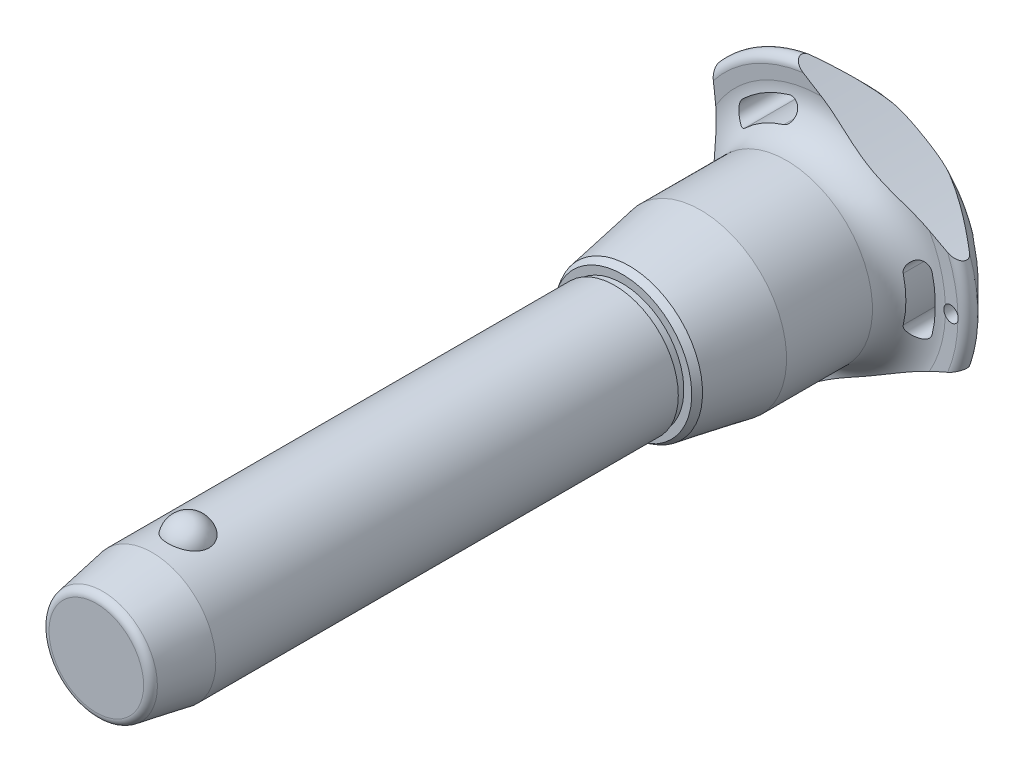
from build123d import *

# Parameters (mm, degrees)
SKETCH1_R           = 12.5
BOSS_EXTRUDE1_DEPTH = 80
SKETCH2_R           = 10
BOSS_EXTRUDE2_DEPTH = 50.7
BOSS_EXTRUDE3_START = 22
SKETCH1_2_R         = 12.5
BOSS_EXTRUDE3_DEPTH = 22
CHAMFER1_SIZE       = 11
CHAMFER1_SIZE2      = 1.939596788
FILLET1_R           = 1.5
SKETCH6_R           = 176.92625
CUT_EXTRUDE1_DEPTH  = 137.79481676
CIRPATTERN1_COUNT   = 3
SKETCH7_R           = 1.5
CUT_EXTRUDE2_DEPTH  = 137.683489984


with BuildPart() as part:
    # Sketch1 → Boss-Extrude1 (new body)
    with BuildSketch(Plane.XY):
        Circle(SKETCH1_R)
    extrude(amount=-BOSS_EXTRUDE1_DEPTH)

    # Sketch2 → Boss-Extrude2 (add)
    with BuildSketch(Plane(origin=(0, 0, -80), x_dir=(-1, 0, 0), z_dir=(0, 0, -1))):
        with Locations(Location((0, 0, 0), (0, 0, 180))):
            Circle(SKETCH2_R)
    extrude(amount=BOSS_EXTRUDE2_DEPTH)

    # Sketch3 → Revolve1 (revolve)
    with BuildSketch(Plane(origin=(0, 0, 0), x_dir=(0, 0, -1), z_dir=(1, 0, 0))):
        with BuildLine():
            Line((-3.957271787, 15.4), (-3.957271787, 7.1))
            ThreePointArc((-3.957271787, 7.1), (0.192728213, 11.25), (-3.957271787, 15.4))
        make_face()
        with BuildLine():
            Line((-3.957271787, -7.1), (-3.957271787, -15.4))
            ThreePointArc((-3.957271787, -15.4), (0.192728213, -11.25), (-3.957271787, -7.1))
        make_face()
    revolve(axis=Axis((0, -7.1, 3.957271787), (0, 1, 0)))

    # Sketch1_2 → Boss-Extrude3 (add)
    with BuildSketch(Plane.XY.offset(BOSS_EXTRUDE3_START)):
        Circle(SKETCH1_2_R)
    extrude(amount=-BOSS_EXTRUDE3_DEPTH)

    # Chamfer1
    chamfer1_edges = [part.edges().sort_by_distance(p)[0] for p in [
        (-12.5, 0, 22),
    ]]
    chamfer1_side = [part.faces().sort_by_distance(p)[0] for p in [
        (-12.5, 0, -29),
    ]]
    chamfer(chamfer1_edges, length=CHAMFER1_SIZE, length2=CHAMFER1_SIZE2, reference=chamfer1_side[0])

    # Fillet1
    fillet1_edges = [part.edges().sort_by_distance(p)[0] for p in [
        (-10.560403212, 0, 22),
        (-10, 0, -130.7),
    ]]
    fillet(fillet1_edges, radius=FILLET1_R)

    # Sketch4 → Revolve2 (revolve)
    with BuildSketch(Plane(origin=(0, 0, 0), x_dir=(0, 0, -1), z_dir=(1, 0, 0)), mode=Mode.PRIVATE) as revolve2_sk:
        Polygon((80, 0), (80, 12.089202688), (81.5, 12.089202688), (81.5, 13.644437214), (82.846872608, 14.422054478), (96.9, 16.9), (113.8, 16.9), (113.8, 0), align=None)
    revolve(revolve2_sk.sketch.rotate(Axis((0, 0, -113.8), (0, 0, 1)), 90), axis=Axis((0, 0, -113.8), (0, 0, 1)))

    # Sketch5 → Revolve3 (revolve)
    with BuildSketch(Plane(origin=(0, 0, 0), x_dir=(0, 0, -1), z_dir=(1, 0, 0)), mode=Mode.PRIVATE) as revolve3_sk:
        with BuildLine():
            Line((120.790129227, 24.271609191), (120.652256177, 26.865060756))
            ThreePointArc((120.652256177, 26.865060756), (121.598671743, 28.411427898), (123.38137085, 28.08137085))
            Line((123.38137085, 28.08137085), (129.763226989, 21.69951471))
            ThreePointArc((129.763226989, 21.69951471), (130.7, 19.381044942), (129.683055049, 17.096604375))
            ThreePointArc((129.683055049, 17.096604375), (124.18864484, 9.321268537), (122.25, 0))
            Line((122.25, 0), (113.8, 0))
            Line((113.8, 0), (113.8, 16.9))
            ThreePointArc((113.8, 16.9), (118.879432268, 19.083427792), (120.790129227, 24.271609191))
        make_face()
    revolve(revolve3_sk.sketch.rotate(Axis((0, 0, -122.25), (0, 0, 1)), 90), axis=Axis((0, 0, -122.25), (0, 0, 1)))

    # Sketch6 → Cut-Extrude1 (cut, through all)
    with BuildSketch(Plane.XY):
        with Locations((-197.42625, 0)):
            Circle(SKETCH6_R)
        with BuildLine():
            ThreePointArc((21.802992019, -5.260839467), (22.428706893, 0), (21.802992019, 5.260839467))
            ThreePointArc((21.802992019, 5.260839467), (19.579234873, 6.620060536), (18.220013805, 4.39630339))
            ThreePointArc((18.220013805, 4.39630339), (18.742902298, 0), (18.220013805, -4.39630339))
            ThreePointArc((18.220013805, -4.39630339), (19.579234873, -6.620060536), (21.802992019, -5.260839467))
        make_face()
    cut_extrude1 = extrude(amount=-CUT_EXTRUDE1_DEPTH, mode=Mode.SUBTRACT)

    # CirPattern1: Cut-Extrude1 ×3 about axis
    cirpattern1_axis = Axis((0, 0, 0), (0, 0, 1))
    for i in range(1, CIRPATTERN1_COUNT):
        add(cut_extrude1.rotate(cirpattern1_axis, i * 360 / CIRPATTERN1_COUNT), mode=Mode.SUBTRACT)

    # Sketch7 → Cut-Extrude2 (cut, through all)
    with BuildSketch(Plane.XY):
        with Locations(Location((25.428706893, 0, 0), (0, 0, 17.230769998))):
            Circle(SKETCH7_R)
    extrude(amount=-CUT_EXTRUDE2_DEPTH, mode=Mode.SUBTRACT)


solid = part.part
